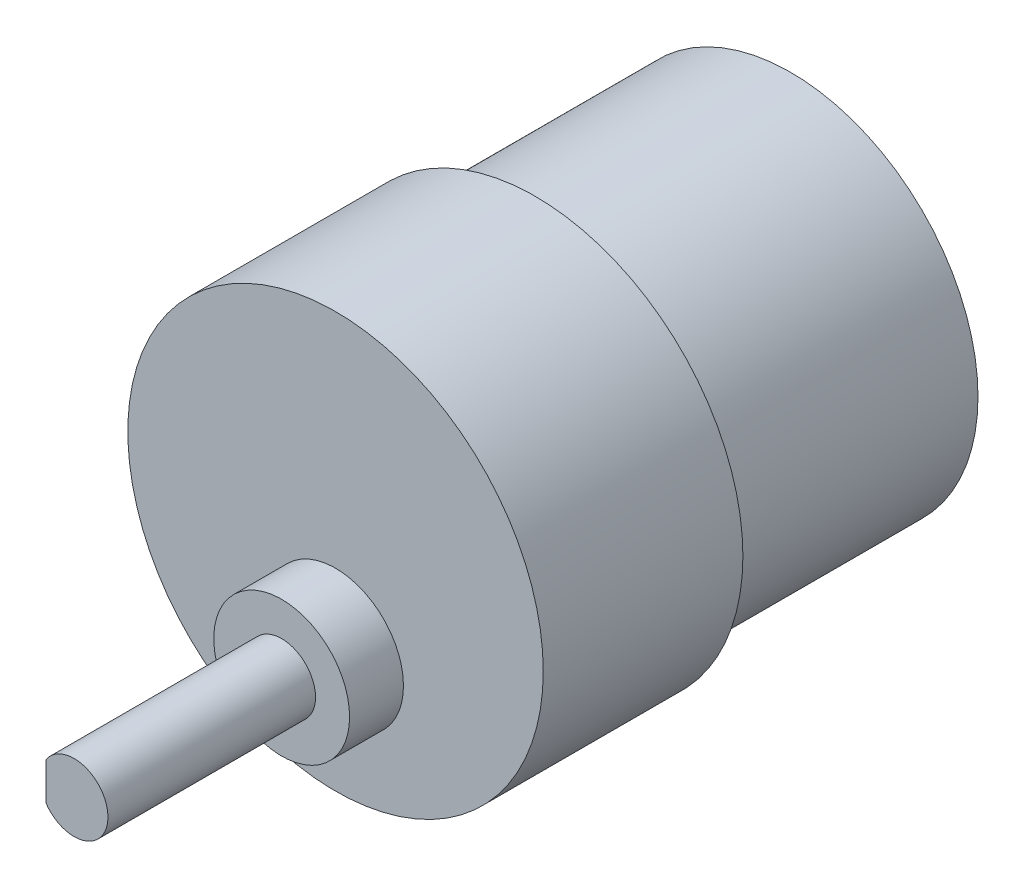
from build123d import *

# Parameters (mm, degrees)
SKETCH1_R           = 16.51
BOSS_EXTRUDE1_DEPTH = 22.5298
SKETCH2_R           = 18.3134
BOSS_EXTRUDE2_DEPTH = 17.6022
SKETCH3_R           = 5.98805
BOSS_EXTRUDE3_DEPTH = 4.7498
SKETCH4_R           = 2.9845
BOSS_EXTRUDE4_DEPTH = 18.3007
SKETCH5_W           = 2.85320155
SKETCH5_H           = 3.33117877
CUT_EXTRUDE1_DEPTH  = 12.192


with BuildPart() as part:
    # Sketch1 → Boss-Extrude1 (new body)
    with BuildSketch(Plane.XY):
        Circle(SKETCH1_R)
    extrude(amount=BOSS_EXTRUDE1_DEPTH)

    # Sketch2 → Boss-Extrude2 (add)
    with BuildSketch(Plane.XY.offset(22.5298)):
        Circle(SKETCH2_R)
    extrude(amount=BOSS_EXTRUDE2_DEPTH)

    # Sketch3 → Boss-Extrude3 (add)
    with BuildSketch(Plane.XY.offset(40.132)):
        with Locations((0, -7.27075)):
            Circle(SKETCH3_R)
    extrude(amount=BOSS_EXTRUDE3_DEPTH)

    # Sketch4 → Boss-Extrude4 (add)
    with BuildSketch(Plane.XY.offset(44.8818)):
        with Locations((0, -7.27075)):
            Circle(SKETCH4_R)
    extrude(amount=BOSS_EXTRUDE4_DEPTH)

    # Sketch5 → Cut-Extrude1 (cut)
    with BuildSketch(Plane.XY.offset(63.1825)):
        with Locations((-3.903100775, -7.27075)):
            Rectangle(SKETCH5_W, SKETCH5_H)
    extrude(amount=-CUT_EXTRUDE1_DEPTH, mode=Mode.SUBTRACT)


solid = part.part
